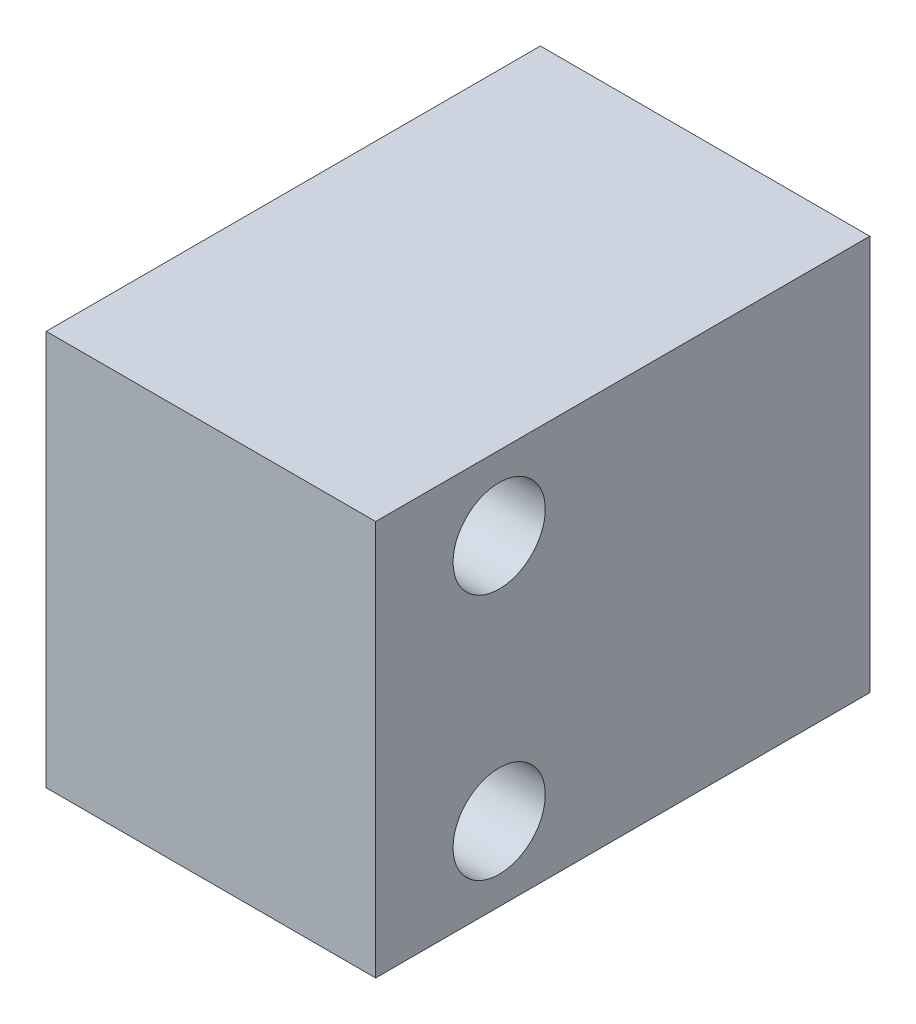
ISO-10303-21;
HEADER;
FILE_DESCRIPTION(('STEP AP214'),'2;1');
FILE_NAME('part.step','',(''),(''),'','','');
FILE_SCHEMA(('AUTOMOTIVE_DESIGN { 1 0 10303 214 1 1 1 1 }'));
ENDSEC;
DATA;
#1=APPLICATION_CONTEXT('core data for automotive mechanical design processes');
#2=APPLICATION_PROTOCOL_DEFINITION('international standard','automotive_design',2000,#1);
#3=PRODUCT_CONTEXT('',#1,'mechanical');
#4=PRODUCT('Part','Part','',(#3));
#5=PRODUCT_RELATED_PRODUCT_CATEGORY('part','',(#4));
#6=PRODUCT_DEFINITION_FORMATION('','',#4);
#7=PRODUCT_DEFINITION_CONTEXT('part definition',#1,'design');
#8=PRODUCT_DEFINITION('design','',#6,#7);
#9=PRODUCT_DEFINITION_SHAPE('','',#8);
#10=(LENGTH_UNIT() NAMED_UNIT(*) SI_UNIT(.MILLI.,.METRE.));
#11=(NAMED_UNIT(*) PLANE_ANGLE_UNIT() SI_UNIT($,.RADIAN.));
#12=(NAMED_UNIT(*) SI_UNIT($,.STERADIAN.) SOLID_ANGLE_UNIT());
#13=UNCERTAINTY_MEASURE_WITH_UNIT(LENGTH_MEASURE(1.E-05),#10,'distance_accuracy_value','');
#14=(GEOMETRIC_REPRESENTATION_CONTEXT(3) GLOBAL_UNCERTAINTY_ASSIGNED_CONTEXT((#13)) GLOBAL_UNIT_ASSIGNED_CONTEXT((#10,
#11,#12)) REPRESENTATION_CONTEXT('',''));
#15=CARTESIAN_POINT('',(0.,0.,0.));
#16=DIRECTION('',(0.,0.,1.));
#17=DIRECTION('',(1.,0.,0.));
#18=AXIS2_PLACEMENT_3D('',#15,#16,#17);
#19=CARTESIAN_POINT('',(-23.,11.9999999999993,-30.));
#20=DIRECTION('',(1.,0.,0.));
#21=DIRECTION('',(0.,0.,-1.));
#22=AXIS2_PLACEMENT_3D('',#19,#20,#21);
#23=PLANE('',#22);
#24=CARTESIAN_POINT('',(-23.,-7.4999999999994,-7.5));
#25=DIRECTION('',(-1.,0.,0.));
#26=DIRECTION('',(0.,0.,1.));
#27=AXIS2_PLACEMENT_3D('',#24,#25,#26);
#28=CIRCLE('',#27,2.8);
#29=CARTESIAN_POINT('',(-23.,-7.4999999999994,-4.7));
#30=VERTEX_POINT('',#29);
#31=EDGE_CURVE('E129',#30,#30,#28,.T.);
#32=ORIENTED_EDGE('',*,*,#31,.T.);
#33=EDGE_LOOP('',(#32));
#34=FACE_BOUND('',#33,.T.);
#35=CARTESIAN_POINT('',(-23.,7.4999999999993,-7.5));
#36=DIRECTION('',(-1.,0.,0.));
#37=DIRECTION('',(0.,0.,1.));
#38=AXIS2_PLACEMENT_3D('',#35,#36,#37);
#39=CIRCLE('',#38,2.8);
#40=CARTESIAN_POINT('',(-23.,7.4999999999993,-4.7));
#41=VERTEX_POINT('',#40);
#42=EDGE_CURVE('E85',#41,#41,#39,.T.);
#43=ORIENTED_EDGE('',*,*,#42,.T.);
#44=EDGE_LOOP('',(#43));
#45=FACE_BOUND('',#44,.T.);
#46=DIRECTION('',(0.,1.,0.));
#47=VECTOR('',#46,1.);
#48=CARTESIAN_POINT('',(-23.,11.9999999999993,0.));
#49=LINE('',#48,#47);
#50=CARTESIAN_POINT('',(-23.,-11.9999999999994,0.));
#51=VERTEX_POINT('',#50);
#52=CARTESIAN_POINT('',(-23.,11.9999999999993,0.));
#53=VERTEX_POINT('',#52);
#54=EDGE_CURVE('E81',#51,#53,#49,.T.);
#55=ORIENTED_EDGE('',*,*,#54,.F.);
#56=DIRECTION('',(0.,0.,1.));
#57=VECTOR('',#56,1.);
#58=CARTESIAN_POINT('',(-23.,-11.9999999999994,-30.));
#59=LINE('',#58,#57);
#60=CARTESIAN_POINT('',(-23.,-11.9999999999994,-30.));
#61=VERTEX_POINT('',#60);
#62=EDGE_CURVE('E11',#61,#51,#59,.T.);
#63=ORIENTED_EDGE('',*,*,#62,.F.);
#64=DIRECTION('',(0.,1.,0.));
#65=VECTOR('',#64,1.);
#66=CARTESIAN_POINT('',(-23.,11.9999999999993,-30.));
#67=LINE('',#66,#65);
#68=CARTESIAN_POINT('',(-23.,11.9999999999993,-30.));
#69=VERTEX_POINT('',#68);
#70=EDGE_CURVE('E74',#61,#69,#67,.T.);
#71=ORIENTED_EDGE('',*,*,#70,.T.);
#72=DIRECTION('',(0.,0.,1.));
#73=VECTOR('',#72,1.);
#74=CARTESIAN_POINT('',(-23.,11.9999999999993,-30.));
#75=LINE('',#74,#73);
#76=EDGE_CURVE('E19',#69,#53,#75,.T.);
#77=ORIENTED_EDGE('',*,*,#76,.T.);
#78=EDGE_LOOP('',(#55,#63,#71,#77));
#79=FACE_BOUND('',#78,.T.);
#80=ADVANCED_FACE('F16',(#34,#45,#79),#23,.T.);
#81=CARTESIAN_POINT('',(-23.,-11.9999999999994,-30.));
#82=DIRECTION('',(0.,-1.,0.));
#83=DIRECTION('',(1.,0.,0.));
#84=AXIS2_PLACEMENT_3D('',#81,#82,#83);
#85=PLANE('',#84);
#86=DIRECTION('',(1.,0.,0.));
#87=VECTOR('',#86,1.);
#88=CARTESIAN_POINT('',(-23.,-11.9999999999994,0.));
#89=LINE('',#88,#87);
#90=CARTESIAN_POINT('',(-43.,-11.9999999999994,0.));
#91=VERTEX_POINT('',#90);
#92=EDGE_CURVE('E76',#91,#51,#89,.T.);
#93=ORIENTED_EDGE('',*,*,#92,.F.);
#94=DIRECTION('',(0.,0.,1.));
#95=VECTOR('',#94,1.);
#96=CARTESIAN_POINT('',(-43.,-11.9999999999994,-30.));
#97=LINE('',#96,#95);
#98=CARTESIAN_POINT('',(-43.,-11.9999999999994,-30.));
#99=VERTEX_POINT('',#98);
#100=EDGE_CURVE('E25',#99,#91,#97,.T.);
#101=ORIENTED_EDGE('',*,*,#100,.F.);
#102=DIRECTION('',(1.,0.,0.));
#103=VECTOR('',#102,1.);
#104=CARTESIAN_POINT('',(-23.,-11.9999999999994,-30.));
#105=LINE('',#104,#103);
#106=EDGE_CURVE('E71',#99,#61,#105,.T.);
#107=ORIENTED_EDGE('',*,*,#106,.T.);
#108=ORIENTED_EDGE('',*,*,#62,.T.);
#109=EDGE_LOOP('',(#93,#101,#107,#108));
#110=FACE_BOUND('',#109,.T.);
#111=ADVANCED_FACE('F92',(#110),#85,.T.);
#112=CARTESIAN_POINT('',(-43.,11.9999999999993,-30.));
#113=DIRECTION('',(-1.,0.,0.));
#114=DIRECTION('',(0.,0.,1.));
#115=AXIS2_PLACEMENT_3D('',#112,#113,#114);
#116=PLANE('',#115);
#117=CARTESIAN_POINT('',(-43.,-7.4999999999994,-7.5));
#118=DIRECTION('',(-1.,0.,0.));
#119=DIRECTION('',(0.,0.,1.));
#120=AXIS2_PLACEMENT_3D('',#117,#118,#119);
#121=CIRCLE('',#120,2.8);
#122=CARTESIAN_POINT('',(-43.,-7.4999999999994,-4.7));
#123=VERTEX_POINT('',#122);
#124=EDGE_CURVE('E132',#123,#123,#121,.T.);
#125=ORIENTED_EDGE('',*,*,#124,.F.);
#126=EDGE_LOOP('',(#125));
#127=FACE_BOUND('',#126,.T.);
#128=CARTESIAN_POINT('',(-43.,7.4999999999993,-7.5));
#129=DIRECTION('',(-1.,0.,0.));
#130=DIRECTION('',(0.,0.,1.));
#131=AXIS2_PLACEMENT_3D('',#128,#129,#130);
#132=CIRCLE('',#131,2.8);
#133=CARTESIAN_POINT('',(-43.,7.4999999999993,-4.7));
#134=VERTEX_POINT('',#133);
#135=EDGE_CURVE('E134',#134,#134,#132,.T.);
#136=ORIENTED_EDGE('',*,*,#135,.F.);
#137=EDGE_LOOP('',(#136));
#138=FACE_BOUND('',#137,.T.);
#139=DIRECTION('',(0.,-1.,0.));
#140=VECTOR('',#139,1.);
#141=CARTESIAN_POINT('',(-43.,11.9999999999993,0.));
#142=LINE('',#141,#140);
#143=CARTESIAN_POINT('',(-43.,11.9999999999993,0.));
#144=VERTEX_POINT('',#143);
#145=EDGE_CURVE('E66',#144,#91,#142,.T.);
#146=ORIENTED_EDGE('',*,*,#145,.F.);
#147=DIRECTION('',(0.,0.,1.));
#148=VECTOR('',#147,1.);
#149=CARTESIAN_POINT('',(-43.,11.9999999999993,-30.));
#150=LINE('',#149,#148);
#151=CARTESIAN_POINT('',(-43.,11.9999999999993,-30.));
#152=VERTEX_POINT('',#151);
#153=EDGE_CURVE('E61',#152,#144,#150,.T.);
#154=ORIENTED_EDGE('',*,*,#153,.F.);
#155=DIRECTION('',(0.,-1.,0.));
#156=VECTOR('',#155,1.);
#157=CARTESIAN_POINT('',(-43.,11.9999999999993,-30.));
#158=LINE('',#157,#156);
#159=EDGE_CURVE('E64',#152,#99,#158,.T.);
#160=ORIENTED_EDGE('',*,*,#159,.T.);
#161=ORIENTED_EDGE('',*,*,#100,.T.);
#162=EDGE_LOOP('',(#146,#154,#160,#161));
#163=FACE_BOUND('',#162,.T.);
#164=ADVANCED_FACE('F63',(#127,#138,#163),#116,.T.);
#165=CARTESIAN_POINT('',(-23.,11.9999999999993,-30.));
#166=DIRECTION('',(0.,1.,0.));
#167=DIRECTION('',(-1.,0.,0.));
#168=AXIS2_PLACEMENT_3D('',#165,#166,#167);
#169=PLANE('',#168);
#170=DIRECTION('',(-1.,0.,0.));
#171=VECTOR('',#170,1.);
#172=CARTESIAN_POINT('',(-23.,11.9999999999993,0.));
#173=LINE('',#172,#171);
#174=EDGE_CURVE('E84',#53,#144,#173,.T.);
#175=ORIENTED_EDGE('',*,*,#174,.F.);
#176=ORIENTED_EDGE('',*,*,#76,.F.);
#177=DIRECTION('',(-1.,0.,0.));
#178=VECTOR('',#177,1.);
#179=CARTESIAN_POINT('',(-23.,11.9999999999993,-30.));
#180=LINE('',#179,#178);
#181=EDGE_CURVE('E70',#69,#152,#180,.T.);
#182=ORIENTED_EDGE('',*,*,#181,.T.);
#183=ORIENTED_EDGE('',*,*,#153,.T.);
#184=EDGE_LOOP('',(#175,#176,#182,#183));
#185=FACE_BOUND('',#184,.T.);
#186=ADVANCED_FACE('F73',(#185),#169,.T.);
#187=CARTESIAN_POINT('',(0.,0.,-30.));
#188=DIRECTION('',(0.,0.,-1.));
#189=DIRECTION('',(-1.,0.,0.));
#190=AXIS2_PLACEMENT_3D('',#187,#188,#189);
#191=PLANE('',#190);
#192=ORIENTED_EDGE('',*,*,#70,.F.);
#193=ORIENTED_EDGE('',*,*,#106,.F.);
#194=ORIENTED_EDGE('',*,*,#159,.F.);
#195=ORIENTED_EDGE('',*,*,#181,.F.);
#196=EDGE_LOOP('',(#192,#193,#194,#195));
#197=FACE_BOUND('',#196,.T.);
#198=ADVANCED_FACE('F69',(#197),#191,.T.);
#199=CARTESIAN_POINT('',(0.,0.,0.));
#200=DIRECTION('',(0.,0.,-1.));
#201=DIRECTION('',(-1.,0.,0.));
#202=AXIS2_PLACEMENT_3D('',#199,#200,#201);
#203=PLANE('',#202);
#204=ORIENTED_EDGE('',*,*,#54,.T.);
#205=ORIENTED_EDGE('',*,*,#174,.T.);
#206=ORIENTED_EDGE('',*,*,#145,.T.);
#207=ORIENTED_EDGE('',*,*,#92,.T.);
#208=EDGE_LOOP('',(#204,#205,#206,#207));
#209=FACE_BOUND('',#208,.T.);
#210=ADVANCED_FACE('F91',(#209),#203,.F.);
#211=CARTESIAN_POINT('',(-43.,7.4999999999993,-7.5));
#212=DIRECTION('',(-1.,0.,0.));
#213=DIRECTION('',(0.,0.,1.));
#214=AXIS2_PLACEMENT_3D('',#211,#212,#213);
#215=CYLINDRICAL_SURFACE('',#214,2.8);
#216=ORIENTED_EDGE('',*,*,#42,.F.);
#217=EDGE_LOOP('',(#216));
#218=FACE_BOUND('',#217,.T.);
#219=ORIENTED_EDGE('',*,*,#135,.T.);
#220=EDGE_LOOP('',(#219));
#221=FACE_BOUND('',#220,.T.);
#222=ADVANCED_FACE('F115',(#218,#221),#215,.F.);
#223=CARTESIAN_POINT('',(-43.,-7.4999999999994,-7.5));
#224=DIRECTION('',(-1.,0.,0.));
#225=DIRECTION('',(0.,0.,1.));
#226=AXIS2_PLACEMENT_3D('',#223,#224,#225);
#227=CYLINDRICAL_SURFACE('',#226,2.8);
#228=ORIENTED_EDGE('',*,*,#31,.F.);
#229=EDGE_LOOP('',(#228));
#230=FACE_BOUND('',#229,.T.);
#231=ORIENTED_EDGE('',*,*,#124,.T.);
#232=EDGE_LOOP('',(#231));
#233=FACE_BOUND('',#232,.T.);
#234=ADVANCED_FACE('F119',(#230,#233),#227,.F.);
#235=CLOSED_SHELL('',(#80,#111,#164,#186,#198,#210,#222,#234));
#236=MANIFOLD_SOLID_BREP('B1',#235);
#237=ADVANCED_BREP_SHAPE_REPRESENTATION('',(#18,#236),#14);
#238=SHAPE_DEFINITION_REPRESENTATION(#9,#237);
ENDSEC;
END-ISO-10303-21;
